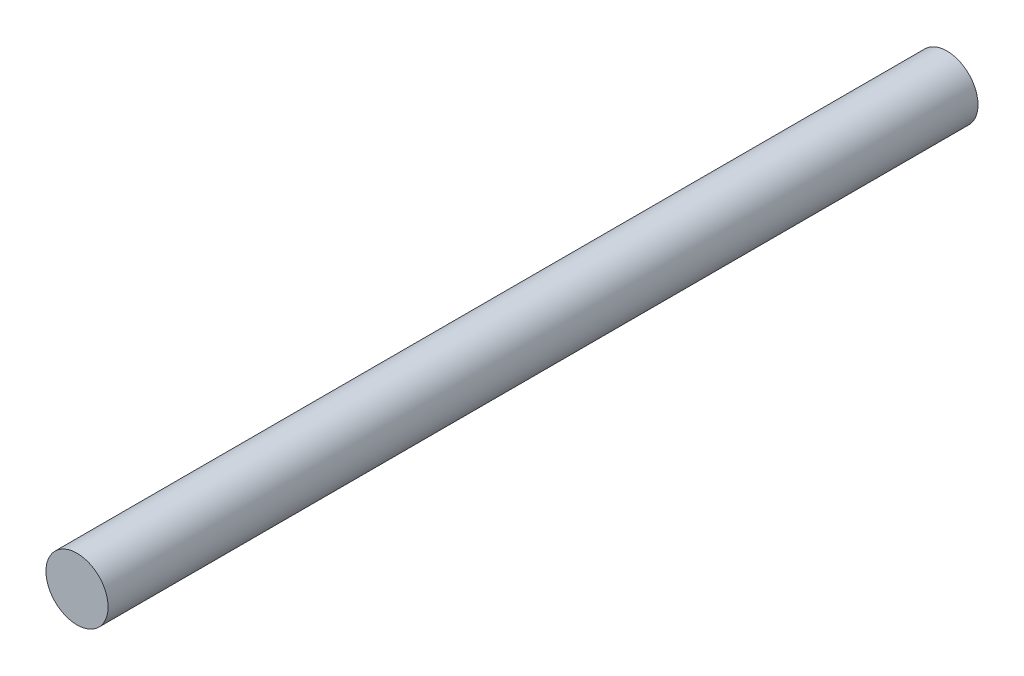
from build123d import *

# Parameters (mm, degrees)
SKETCH1_R           = 5.715
BOSS_EXTRUDE1_DEPTH = 80


with BuildPart() as part:
    # Sketch1 → Boss-Extrude1 (new, symmetric)
    with BuildSketch(Plane.XY):
        Circle(SKETCH1_R)
    extrude(amount=BOSS_EXTRUDE1_DEPTH, both=True)


solid = part.part
